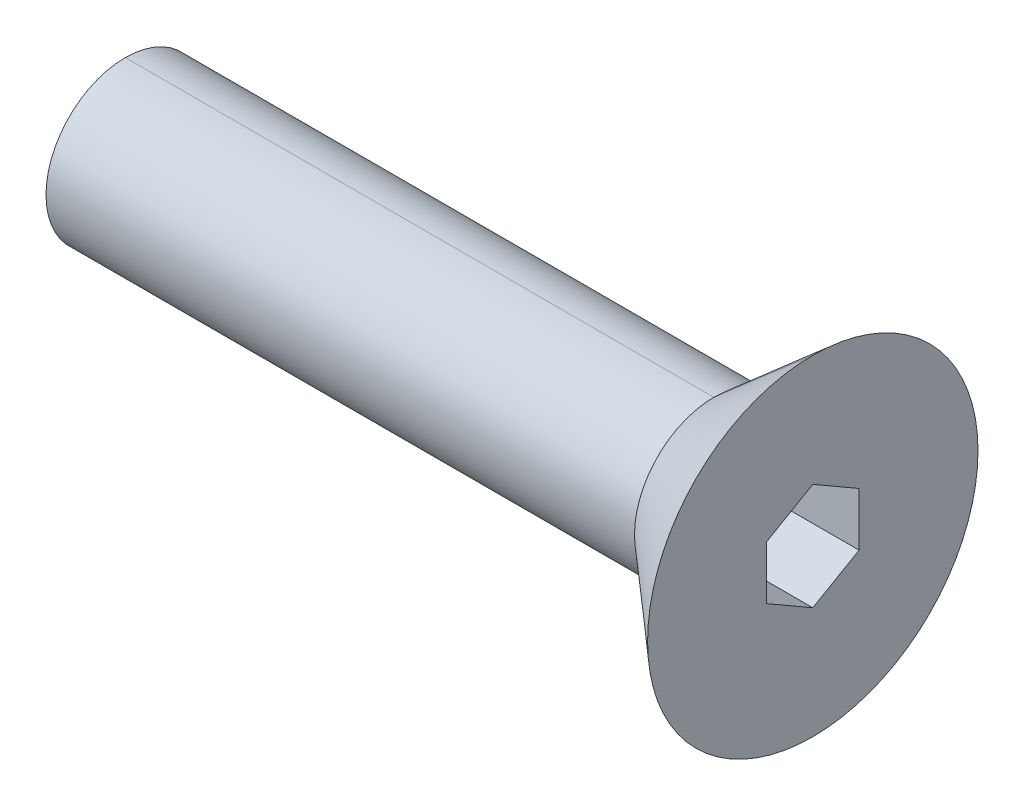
ISO-10303-21;
HEADER;
FILE_DESCRIPTION(('STEP AP214'),'2;1');
FILE_NAME('part.step','',(''),(''),'','','');
FILE_SCHEMA(('AUTOMOTIVE_DESIGN { 1 0 10303 214 1 1 1 1 }'));
ENDSEC;
DATA;
#1=APPLICATION_CONTEXT('core data for automotive mechanical design processes');
#2=APPLICATION_PROTOCOL_DEFINITION('international standard','automotive_design',2000,#1);
#3=PRODUCT_CONTEXT('',#1,'mechanical');
#4=PRODUCT('Part','Part','',(#3));
#5=PRODUCT_RELATED_PRODUCT_CATEGORY('part','',(#4));
#6=PRODUCT_DEFINITION_FORMATION('','',#4);
#7=PRODUCT_DEFINITION_CONTEXT('part definition',#1,'design');
#8=PRODUCT_DEFINITION('design','',#6,#7);
#9=PRODUCT_DEFINITION_SHAPE('','',#8);
#10=(LENGTH_UNIT() NAMED_UNIT(*) SI_UNIT(.MILLI.,.METRE.));
#11=(NAMED_UNIT(*) PLANE_ANGLE_UNIT() SI_UNIT($,.RADIAN.));
#12=(NAMED_UNIT(*) SI_UNIT($,.STERADIAN.) SOLID_ANGLE_UNIT());
#13=UNCERTAINTY_MEASURE_WITH_UNIT(LENGTH_MEASURE(1.E-05),#10,'distance_accuracy_value','');
#14=(GEOMETRIC_REPRESENTATION_CONTEXT(3) GLOBAL_UNCERTAINTY_ASSIGNED_CONTEXT((#13)) GLOBAL_UNIT_ASSIGNED_CONTEXT((#10,
#11,#12)) REPRESENTATION_CONTEXT('',''));
#15=CARTESIAN_POINT('',(0.,0.,0.));
#16=DIRECTION('',(0.,0.,1.));
#17=DIRECTION('',(1.,0.,0.));
#18=AXIS2_PLACEMENT_3D('',#15,#16,#17);
#19=CARTESIAN_POINT('',(15.08125,0.,0.));
#20=DIRECTION('',(-1.,0.,0.));
#21=DIRECTION('',(0.,-1.,0.));
#22=AXIS2_PLACEMENT_3D('',#19,#20,#21);
#23=PLANE('',#22);
#24=DIRECTION('',(0.,1.,0.));
#25=VECTOR('',#24,1.);
#26=CARTESIAN_POINT('',(15.08125,1.60395121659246,2.778125));
#27=LINE('',#26,#25);
#28=CARTESIAN_POINT('',(15.08125,1.60395121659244,2.77812499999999));
#29=VERTEX_POINT('',#28);
#30=CARTESIAN_POINT('',(15.08125,-1.60395121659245,2.778125));
#31=VERTEX_POINT('',#30);
#32=EDGE_CURVE('E100',#29,#31,#27,.F.);
#33=ORIENTED_EDGE('',*,*,#32,.T.);
#34=DIRECTION('',(0.,-0.499999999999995,-0.866025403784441));
#35=VECTOR('',#34,1.);
#36=CARTESIAN_POINT('',(15.08125,-1.60395121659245,2.778125));
#37=LINE('',#36,#35);
#38=CARTESIAN_POINT('',(15.08125,-3.20790243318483,0.));
#39=VERTEX_POINT('',#38);
#40=EDGE_CURVE('E121',#31,#39,#37,.T.);
#41=ORIENTED_EDGE('',*,*,#40,.T.);
#42=DIRECTION('',(0.,0.500000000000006,-0.866025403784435));
#43=VECTOR('',#42,1.);
#44=CARTESIAN_POINT('',(15.08125,-3.20790243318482,0.));
#45=LINE('',#44,#43);
#46=CARTESIAN_POINT('',(15.08125,-1.60395121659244,-2.77812499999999));
#47=VERTEX_POINT('',#46);
#48=EDGE_CURVE('E135',#39,#47,#45,.T.);
#49=ORIENTED_EDGE('',*,*,#48,.T.);
#50=DIRECTION('',(0.,1.,0.));
#51=VECTOR('',#50,1.);
#52=CARTESIAN_POINT('',(15.08125,-1.60395121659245,-2.778125));
#53=LINE('',#52,#51);
#54=CARTESIAN_POINT('',(15.08125,1.60395121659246,-2.778125));
#55=VERTEX_POINT('',#54);
#56=EDGE_CURVE('E139',#47,#55,#53,.T.);
#57=ORIENTED_EDGE('',*,*,#56,.T.);
#58=DIRECTION('',(0.,0.500000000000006,0.866025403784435));
#59=VECTOR('',#58,1.);
#60=CARTESIAN_POINT('',(15.08125,1.60395121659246,-2.778125));
#61=LINE('',#60,#59);
#62=CARTESIAN_POINT('',(15.08125,3.20790243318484,0.));
#63=VERTEX_POINT('',#62);
#64=EDGE_CURVE('E103',#55,#63,#61,.T.);
#65=ORIENTED_EDGE('',*,*,#64,.T.);
#66=DIRECTION('',(0.,-0.500000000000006,0.866025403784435));
#67=VECTOR('',#66,1.);
#68=CARTESIAN_POINT('',(15.08125,3.20790243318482,0.));
#69=LINE('',#68,#67);
#70=EDGE_CURVE('E104',#63,#29,#69,.T.);
#71=ORIENTED_EDGE('',*,*,#70,.T.);
#72=EDGE_LOOP('',(#33,#41,#49,#57,#65,#71));
#73=FACE_BOUND('',#72,.T.);
#74=ADVANCED_FACE('F16',(#73),#23,.F.);
#75=CARTESIAN_POINT('',(15.08125,1.60395121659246,2.778125));
#76=DIRECTION('',(0.,0.,1.));
#77=DIRECTION('',(1.,0.,0.));
#78=AXIS2_PLACEMENT_3D('',#75,#76,#77);
#79=PLANE('',#78);
#80=DIRECTION('',(1.,0.,0.));
#81=VECTOR('',#80,1.);
#82=CARTESIAN_POINT('',(15.08125,-1.60395121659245,2.778125));
#83=LINE('',#82,#81);
#84=CARTESIAN_POINT('',(20.6375,-1.60395121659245,2.778125));
#85=VERTEX_POINT('',#84);
#86=EDGE_CURVE('E131',#85,#31,#83,.F.);
#87=ORIENTED_EDGE('',*,*,#86,.T.);
#88=ORIENTED_EDGE('',*,*,#32,.F.);
#89=DIRECTION('',(1.,0.,0.));
#90=VECTOR('',#89,1.);
#91=CARTESIAN_POINT('',(15.08125,1.60395121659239,2.77812499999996));
#92=LINE('',#91,#90);
#93=CARTESIAN_POINT('',(20.6375,1.60395121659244,2.77812499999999));
#94=VERTEX_POINT('',#93);
#95=EDGE_CURVE('E97',#29,#94,#92,.T.);
#96=ORIENTED_EDGE('',*,*,#95,.T.);
#97=DIRECTION('',(0.,1.,0.));
#98=VECTOR('',#97,1.);
#99=CARTESIAN_POINT('',(20.6375,-4.95934999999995,2.778125));
#100=LINE('',#99,#98);
#101=EDGE_CURVE('E93',#85,#94,#100,.T.);
#102=ORIENTED_EDGE('',*,*,#101,.F.);
#103=EDGE_LOOP('',(#87,#88,#96,#102));
#104=FACE_BOUND('',#103,.T.);
#105=ADVANCED_FACE('F99',(#104),#79,.F.);
#106=CARTESIAN_POINT('',(15.08125,3.20790243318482,0.));
#107=DIRECTION('',(0.,0.866025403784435,0.500000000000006));
#108=DIRECTION('',(0.,-0.500000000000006,0.866025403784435));
#109=AXIS2_PLACEMENT_3D('',#106,#107,#108);
#110=PLANE('',#109);
#111=ORIENTED_EDGE('',*,*,#95,.F.);
#112=ORIENTED_EDGE('',*,*,#70,.F.);
#113=DIRECTION('',(1.,0.,0.));
#114=VECTOR('',#113,1.);
#115=CARTESIAN_POINT('',(15.08125,3.20790243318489,0.));
#116=LINE('',#115,#114);
#117=CARTESIAN_POINT('',(20.6375,3.20790243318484,0.));
#118=VERTEX_POINT('',#117);
#119=EDGE_CURVE('E110',#63,#118,#116,.T.);
#120=ORIENTED_EDGE('',*,*,#119,.T.);
#121=DIRECTION('',(0.,0.499999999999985,-0.866025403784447));
#122=VECTOR('',#121,1.);
#123=CARTESIAN_POINT('',(20.6375,1.60395121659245,2.778125));
#124=LINE('',#123,#122);
#125=EDGE_CURVE('E107',#94,#118,#124,.T.);
#126=ORIENTED_EDGE('',*,*,#125,.F.);
#127=EDGE_LOOP('',(#111,#112,#120,#126));
#128=FACE_BOUND('',#127,.T.);
#129=ADVANCED_FACE('F108',(#128),#110,.F.);
#130=CARTESIAN_POINT('',(15.08125,1.60395121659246,-2.778125));
#131=DIRECTION('',(0.,0.866025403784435,-0.500000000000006));
#132=DIRECTION('',(0.,0.500000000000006,0.866025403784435));
#133=AXIS2_PLACEMENT_3D('',#130,#131,#132);
#134=PLANE('',#133);
#135=ORIENTED_EDGE('',*,*,#119,.F.);
#136=ORIENTED_EDGE('',*,*,#64,.F.);
#137=DIRECTION('',(-1.,0.,0.));
#138=VECTOR('',#137,1.);
#139=CARTESIAN_POINT('',(15.08125,1.60395121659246,-2.778125));
#140=LINE('',#139,#138);
#141=CARTESIAN_POINT('',(20.6375,1.60395121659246,-2.778125));
#142=VERTEX_POINT('',#141);
#143=EDGE_CURVE('E137',#55,#142,#140,.F.);
#144=ORIENTED_EDGE('',*,*,#143,.T.);
#145=DIRECTION('',(0.,-0.499999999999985,-0.866025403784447));
#146=VECTOR('',#145,1.);
#147=CARTESIAN_POINT('',(20.6375,3.20790243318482,0.));
#148=LINE('',#147,#146);
#149=EDGE_CURVE('E114',#118,#142,#148,.T.);
#150=ORIENTED_EDGE('',*,*,#149,.F.);
#151=EDGE_LOOP('',(#135,#136,#144,#150));
#152=FACE_BOUND('',#151,.T.);
#153=ADVANCED_FACE('F177',(#152),#134,.F.);
#154=CARTESIAN_POINT('',(15.08125,-1.60395121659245,-2.778125));
#155=DIRECTION('',(0.,0.,-1.));
#156=DIRECTION('',(-1.,0.,0.));
#157=AXIS2_PLACEMENT_3D('',#154,#155,#156);
#158=PLANE('',#157);
#159=ORIENTED_EDGE('',*,*,#143,.F.);
#160=ORIENTED_EDGE('',*,*,#56,.F.);
#161=DIRECTION('',(1.,0.,0.));
#162=VECTOR('',#161,1.);
#163=CARTESIAN_POINT('',(15.08125,-1.60395121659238,-2.77812499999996));
#164=LINE('',#163,#162);
#165=CARTESIAN_POINT('',(20.6375,-1.60395121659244,-2.77812499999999));
#166=VERTEX_POINT('',#165);
#167=EDGE_CURVE('E133',#47,#166,#164,.T.);
#168=ORIENTED_EDGE('',*,*,#167,.T.);
#169=DIRECTION('',(0.,1.,0.));
#170=VECTOR('',#169,1.);
#171=CARTESIAN_POINT('',(20.6375,-4.95934999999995,-2.778125));
#172=LINE('',#171,#170);
#173=EDGE_CURVE('E173',#142,#166,#172,.F.);
#174=ORIENTED_EDGE('',*,*,#173,.F.);
#175=EDGE_LOOP('',(#159,#160,#168,#174));
#176=FACE_BOUND('',#175,.T.);
#177=ADVANCED_FACE('F182',(#176),#158,.F.);
#178=CARTESIAN_POINT('',(15.08125,-3.20790243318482,0.));
#179=DIRECTION('',(0.,-0.866025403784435,-0.500000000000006));
#180=DIRECTION('',(0.,0.500000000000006,-0.866025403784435));
#181=AXIS2_PLACEMENT_3D('',#178,#179,#180);
#182=PLANE('',#181);
#183=ORIENTED_EDGE('',*,*,#167,.F.);
#184=ORIENTED_EDGE('',*,*,#48,.F.);
#185=DIRECTION('',(1.,0.,0.));
#186=VECTOR('',#185,1.);
#187=CARTESIAN_POINT('',(15.08125,-3.20790243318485,0.));
#188=LINE('',#187,#186);
#189=CARTESIAN_POINT('',(20.6375,-3.20790243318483,0.));
#190=VERTEX_POINT('',#189);
#191=EDGE_CURVE('E78',#39,#190,#188,.T.);
#192=ORIENTED_EDGE('',*,*,#191,.T.);
#193=DIRECTION('',(0.,-0.499999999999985,0.866025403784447));
#194=VECTOR('',#193,1.);
#195=CARTESIAN_POINT('',(20.6375,-1.60395121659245,-2.778125));
#196=LINE('',#195,#194);
#197=EDGE_CURVE('E171',#166,#190,#196,.T.);
#198=ORIENTED_EDGE('',*,*,#197,.F.);
#199=EDGE_LOOP('',(#183,#184,#192,#198));
#200=FACE_BOUND('',#199,.T.);
#201=ADVANCED_FACE('F184',(#200),#182,.F.);
#202=CARTESIAN_POINT('',(15.08125,-1.60395121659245,2.778125));
#203=DIRECTION('',(0.,-0.866025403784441,0.499999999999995));
#204=DIRECTION('',(0.,-0.499999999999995,-0.866025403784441));
#205=AXIS2_PLACEMENT_3D('',#202,#203,#204);
#206=PLANE('',#205);
#207=ORIENTED_EDGE('',*,*,#191,.F.);
#208=ORIENTED_EDGE('',*,*,#40,.F.);
#209=ORIENTED_EDGE('',*,*,#86,.F.);
#210=DIRECTION('',(0.,0.499999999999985,0.866025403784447));
#211=VECTOR('',#210,1.);
#212=CARTESIAN_POINT('',(20.6375,-3.20790243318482,0.));
#213=LINE('',#212,#211);
#214=EDGE_CURVE('E119',#190,#85,#213,.T.);
#215=ORIENTED_EDGE('',*,*,#214,.F.);
#216=EDGE_LOOP('',(#207,#208,#209,#215));
#217=FACE_BOUND('',#216,.T.);
#218=ADVANCED_FACE('F186',(#217),#206,.F.);
#219=CARTESIAN_POINT('',(20.6375,-4.95934999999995,0.));
#220=DIRECTION('',(1.,0.,0.));
#221=DIRECTION('',(0.,1.,0.));
#222=AXIS2_PLACEMENT_3D('',#219,#220,#221);
#223=PLANE('',#222);
#224=CARTESIAN_POINT('',(20.6375000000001,0.,0.));
#225=DIRECTION('',(1.,0.,0.));
#226=DIRECTION('',(0.,1.,0.));
#227=AXIS2_PLACEMENT_3D('',#224,#225,#226);
#228=CIRCLE('',#227,9.91869999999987);
#229=CARTESIAN_POINT('',(20.6375000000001,-9.91869999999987,0.));
#230=VERTEX_POINT('',#229);
#231=CARTESIAN_POINT('',(20.6375000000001,9.91869999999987,0.));
#232=VERTEX_POINT('',#231);
#233=EDGE_CURVE('E126',#230,#232,#228,.F.);
#234=ORIENTED_EDGE('',*,*,#233,.F.);
#235=CARTESIAN_POINT('',(20.6375000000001,0.,0.));
#236=DIRECTION('',(1.,0.,0.));
#237=DIRECTION('',(0.,1.,0.));
#238=AXIS2_PLACEMENT_3D('',#235,#236,#237);
#239=CIRCLE('',#238,9.91869999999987);
#240=EDGE_CURVE('E19',#232,#230,#239,.F.);
#241=ORIENTED_EDGE('',*,*,#240,.F.);
#242=EDGE_LOOP('',(#234,#241));
#243=FACE_BOUND('',#242,.T.);
#244=ORIENTED_EDGE('',*,*,#197,.T.);
#245=ORIENTED_EDGE('',*,*,#214,.T.);
#246=ORIENTED_EDGE('',*,*,#101,.T.);
#247=ORIENTED_EDGE('',*,*,#125,.T.);
#248=ORIENTED_EDGE('',*,*,#149,.T.);
#249=ORIENTED_EDGE('',*,*,#173,.T.);
#250=EDGE_LOOP('',(#244,#245,#246,#247,#248,#249));
#251=FACE_BOUND('',#250,.T.);
#252=ADVANCED_FACE('F118',(#243,#251),#223,.T.);
#253=CARTESIAN_POINT('',(20.6375000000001,0.,0.));
#254=DIRECTION('',(1.,0.,0.));
#255=DIRECTION('',(0.,1.,0.));
#256=AXIS2_PLACEMENT_3D('',#253,#254,#255);
#257=CONICAL_SURFACE('',#256,9.91869999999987,0.714578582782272);
#258=DIRECTION('',(-0.755369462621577,-0.655299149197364,0.));
#259=VECTOR('',#258,1.);
#260=CARTESIAN_POINT('',(17.6657000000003,7.34059999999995,0.));
#261=LINE('',#260,#259);
#262=CARTESIAN_POINT('',(14.6939000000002,4.76249999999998,0.));
#263=VERTEX_POINT('',#262);
#264=EDGE_CURVE('E150',#232,#263,#261,.T.);
#265=ORIENTED_EDGE('',*,*,#264,.F.);
#266=ORIENTED_EDGE('',*,*,#240,.T.);
#267=DIRECTION('',(-0.755369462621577,0.655299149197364,0.));
#268=VECTOR('',#267,1.);
#269=CARTESIAN_POINT('',(17.6657000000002,-7.34059999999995,0.));
#270=LINE('',#269,#268);
#271=CARTESIAN_POINT('',(14.6939000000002,-4.76249999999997,0.));
#272=VERTEX_POINT('',#271);
#273=EDGE_CURVE('E34',#272,#230,#270,.F.);
#274=ORIENTED_EDGE('',*,*,#273,.F.);
#275=CARTESIAN_POINT('',(14.6939000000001,0.,0.));
#276=DIRECTION('',(1.,0.,0.));
#277=DIRECTION('',(0.,1.,0.));
#278=AXIS2_PLACEMENT_3D('',#275,#276,#277);
#279=CIRCLE('',#278,4.7625);
#280=EDGE_CURVE('E151',#263,#272,#279,.F.);
#281=ORIENTED_EDGE('',*,*,#280,.F.);
#282=EDGE_LOOP('',(#265,#266,#274,#281));
#283=FACE_BOUND('',#282,.T.);
#284=ADVANCED_FACE('F214',(#283),#257,.T.);
#285=CARTESIAN_POINT('',(-20.6375,0.,0.));
#286=DIRECTION('',(-1.,0.,0.));
#287=DIRECTION('',(0.,0.,1.));
#288=AXIS2_PLACEMENT_3D('',#285,#286,#287);
#289=PLANE('',#288);
#290=CARTESIAN_POINT('',(-20.6375,0.,0.));
#291=DIRECTION('',(1.,0.,0.));
#292=DIRECTION('',(0.,1.,0.));
#293=AXIS2_PLACEMENT_3D('',#290,#291,#292);
#294=CIRCLE('',#293,4.7625);
#295=CARTESIAN_POINT('',(-20.6375,4.7625,0.));
#296=VERTEX_POINT('',#295);
#297=CARTESIAN_POINT('',(-20.6375,-4.7625,0.));
#298=VERTEX_POINT('',#297);
#299=EDGE_CURVE('E145',#296,#298,#294,.T.);
#300=ORIENTED_EDGE('',*,*,#299,.F.);
#301=CARTESIAN_POINT('',(-20.6375,0.,0.));
#302=DIRECTION('',(1.,0.,0.));
#303=DIRECTION('',(0.,1.,0.));
#304=AXIS2_PLACEMENT_3D('',#301,#302,#303);
#305=CIRCLE('',#304,4.7625);
#306=EDGE_CURVE('E127',#298,#296,#305,.T.);
#307=ORIENTED_EDGE('',*,*,#306,.F.);
#308=EDGE_LOOP('',(#300,#307));
#309=FACE_BOUND('',#308,.T.);
#310=ADVANCED_FACE('F211',(#309),#289,.T.);
#311=CARTESIAN_POINT('',(-1.18109999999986,0.,0.));
#312=DIRECTION('',(1.,0.,0.));
#313=DIRECTION('',(0.,1.,0.));
#314=AXIS2_PLACEMENT_3D('',#311,#312,#313);
#315=CYLINDRICAL_SURFACE('',#314,4.7625);
#316=DIRECTION('',(1.,0.,0.));
#317=VECTOR('',#316,1.);
#318=CARTESIAN_POINT('',(-1.18109999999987,-4.7625,0.));
#319=LINE('',#318,#317);
#320=EDGE_CURVE('E25',#298,#272,#319,.T.);
#321=ORIENTED_EDGE('',*,*,#320,.F.);
#322=ORIENTED_EDGE('',*,*,#306,.T.);
#323=DIRECTION('',(1.,0.,0.));
#324=VECTOR('',#323,1.);
#325=CARTESIAN_POINT('',(-1.18109999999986,4.7625,0.));
#326=LINE('',#325,#324);
#327=EDGE_CURVE('E148',#263,#296,#326,.F.);
#328=ORIENTED_EDGE('',*,*,#327,.F.);
#329=ORIENTED_EDGE('',*,*,#280,.T.);
#330=EDGE_LOOP('',(#321,#322,#328,#329));
#331=FACE_BOUND('',#330,.T.);
#332=ADVANCED_FACE('F204',(#331),#315,.T.);
#333=CARTESIAN_POINT('',(20.6375000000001,0.,0.));
#334=DIRECTION('',(1.,0.,0.));
#335=DIRECTION('',(0.,1.,0.));
#336=AXIS2_PLACEMENT_3D('',#333,#334,#335);
#337=CONICAL_SURFACE('',#336,9.91869999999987,0.714578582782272);
#338=ORIENTED_EDGE('',*,*,#264,.T.);
#339=CARTESIAN_POINT('',(14.6939000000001,0.,0.));
#340=DIRECTION('',(1.,0.,0.));
#341=DIRECTION('',(0.,1.,0.));
#342=AXIS2_PLACEMENT_3D('',#339,#340,#341);
#343=CIRCLE('',#342,4.7625);
#344=EDGE_CURVE('E11',#272,#263,#343,.F.);
#345=ORIENTED_EDGE('',*,*,#344,.F.);
#346=ORIENTED_EDGE('',*,*,#273,.T.);
#347=ORIENTED_EDGE('',*,*,#233,.T.);
#348=EDGE_LOOP('',(#338,#345,#346,#347));
#349=FACE_BOUND('',#348,.T.);
#350=ADVANCED_FACE('F198',(#349),#337,.T.);
#351=CARTESIAN_POINT('',(-1.18109999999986,0.,0.));
#352=DIRECTION('',(1.,0.,0.));
#353=DIRECTION('',(0.,1.,0.));
#354=AXIS2_PLACEMENT_3D('',#351,#352,#353);
#355=CYLINDRICAL_SURFACE('',#354,4.7625);
#356=ORIENTED_EDGE('',*,*,#320,.T.);
#357=ORIENTED_EDGE('',*,*,#344,.T.);
#358=ORIENTED_EDGE('',*,*,#327,.T.);
#359=ORIENTED_EDGE('',*,*,#299,.T.);
#360=EDGE_LOOP('',(#356,#357,#358,#359));
#361=FACE_BOUND('',#360,.T.);
#362=ADVANCED_FACE('F196',(#361),#355,.T.);
#363=CLOSED_SHELL('',(#74,#105,#129,#153,#177,#201,#218,#252,#284,#310,#332,#350,#362));
#364=MANIFOLD_SOLID_BREP('B1',#363);
#365=ADVANCED_BREP_SHAPE_REPRESENTATION('',(#18,#364),#14);
#366=SHAPE_DEFINITION_REPRESENTATION(#9,#365);
ENDSEC;
END-ISO-10303-21;
